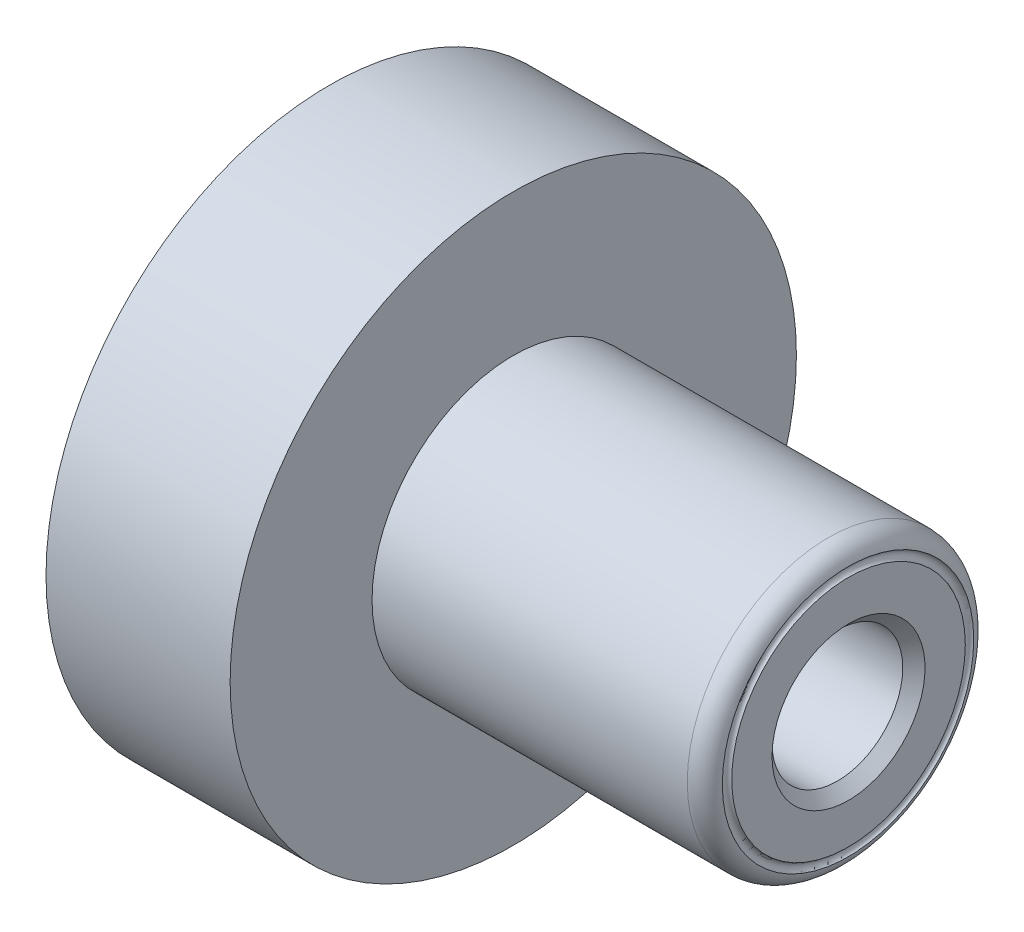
ISO-10303-21;
HEADER;
FILE_DESCRIPTION(('STEP AP214'),'2;1');
FILE_NAME('part.step','',(''),(''),'','','');
FILE_SCHEMA(('AUTOMOTIVE_DESIGN { 1 0 10303 214 1 1 1 1 }'));
ENDSEC;
DATA;
#1=APPLICATION_CONTEXT('core data for automotive mechanical design processes');
#2=APPLICATION_PROTOCOL_DEFINITION('international standard','automotive_design',2000,#1);
#3=PRODUCT_CONTEXT('',#1,'mechanical');
#4=PRODUCT('Part','Part','',(#3));
#5=PRODUCT_RELATED_PRODUCT_CATEGORY('part','',(#4));
#6=PRODUCT_DEFINITION_FORMATION('','',#4);
#7=PRODUCT_DEFINITION_CONTEXT('part definition',#1,'design');
#8=PRODUCT_DEFINITION('design','',#6,#7);
#9=PRODUCT_DEFINITION_SHAPE('','',#8);
#10=(LENGTH_UNIT() NAMED_UNIT(*) SI_UNIT(.MILLI.,.METRE.));
#11=(NAMED_UNIT(*) PLANE_ANGLE_UNIT() SI_UNIT($,.RADIAN.));
#12=(NAMED_UNIT(*) SI_UNIT($,.STERADIAN.) SOLID_ANGLE_UNIT());
#13=UNCERTAINTY_MEASURE_WITH_UNIT(LENGTH_MEASURE(1.E-05),#10,'distance_accuracy_value','');
#14=(GEOMETRIC_REPRESENTATION_CONTEXT(3) GLOBAL_UNCERTAINTY_ASSIGNED_CONTEXT((#13)) GLOBAL_UNIT_ASSIGNED_CONTEXT((#10,
#11,#12)) REPRESENTATION_CONTEXT('',''));
#15=CARTESIAN_POINT('',(0.,0.,0.));
#16=DIRECTION('',(0.,0.,1.));
#17=DIRECTION('',(1.,0.,0.));
#18=AXIS2_PLACEMENT_3D('',#15,#16,#17);
#19=CARTESIAN_POINT('',(40.767,9.5171,0.));
#20=DIRECTION('',(-1.,0.,0.));
#21=DIRECTION('',(0.,0.,1.));
#22=AXIS2_PLACEMENT_3D('',#19,#20,#21);
#23=PLANE('',#22);
#24=CARTESIAN_POINT('',(40.767,0.,0.));
#25=DIRECTION('',(-1.,0.,0.));
#26=DIRECTION('',(0.,0.,1.));
#27=AXIS2_PLACEMENT_3D('',#24,#25,#26);
#28=CIRCLE('',#27,6.00500000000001);
#29=CARTESIAN_POINT('',(40.767,0.,6.00500000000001));
#30=VERTEX_POINT('',#29);
#31=EDGE_CURVE('E10',#30,#30,#28,.T.);
#32=ORIENTED_EDGE('',*,*,#31,.T.);
#33=EDGE_LOOP('',(#32));
#34=FACE_BOUND('',#33,.T.);
#35=CARTESIAN_POINT('',(40.767,0.,0.));
#36=DIRECTION('',(1.,0.,0.));
#37=DIRECTION('',(0.,0.,-1.));
#38=AXIS2_PLACEMENT_3D('',#35,#36,#37);
#39=CIRCLE('',#38,9.16686455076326);
#40=CARTESIAN_POINT('',(40.767,0.,-9.16686455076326));
#41=VERTEX_POINT('',#40);
#42=EDGE_CURVE('E78',#41,#41,#39,.F.);
#43=ORIENTED_EDGE('',*,*,#42,.F.);
#44=EDGE_LOOP('',(#43));
#45=FACE_BOUND('',#44,.T.);
#46=ADVANCED_FACE('F31',(#34,#45),#23,.F.);
#47=CARTESIAN_POINT('',(39.197,0.,0.));
#48=DIRECTION('',(-1.,0.,0.));
#49=DIRECTION('',(0.,0.,1.));
#50=AXIS2_PLACEMENT_3D('',#47,#48,#49);
#51=TOROIDAL_SURFACE('',#50,9.5171,1.57);
#52=CARTESIAN_POINT('',(39.197,0.,0.));
#53=DIRECTION('',(-1.,0.,0.));
#54=DIRECTION('',(0.,0.,1.));
#55=AXIS2_PLACEMENT_3D('',#52,#53,#54);
#56=CIRCLE('',#55,11.0871);
#57=CARTESIAN_POINT('',(39.197,0.,11.0871));
#58=VERTEX_POINT('',#57);
#59=EDGE_CURVE('E48',#58,#58,#56,.T.);
#60=ORIENTED_EDGE('',*,*,#59,.F.);
#61=EDGE_LOOP('',(#60));
#62=FACE_BOUND('',#61,.T.);
#63=CARTESIAN_POINT('',(40.7276717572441,0.,0.));
#64=DIRECTION('',(1.,0.,0.));
#65=DIRECTION('',(0.,0.,-1.));
#66=AXIS2_PLACEMENT_3D('',#63,#64,#65);
#67=CIRCLE('',#66,9.86630477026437);
#68=CARTESIAN_POINT('',(40.7276717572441,0.,-9.86630477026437));
#69=VERTEX_POINT('',#68);
#70=EDGE_CURVE('E35',#69,#69,#67,.T.);
#71=ORIENTED_EDGE('',*,*,#70,.F.);
#72=EDGE_LOOP('',(#71));
#73=FACE_BOUND('',#72,.T.);
#74=ADVANCED_FACE('F87',(#62,#73),#51,.T.);
#75=CARTESIAN_POINT('',(0.,0.,0.));
#76=DIRECTION('',(-1.,0.,0.));
#77=DIRECTION('',(0.,0.,1.));
#78=AXIS2_PLACEMENT_3D('',#75,#76,#77);
#79=CYLINDRICAL_SURFACE('',#78,8.128);
#80=CARTESIAN_POINT('',(28.067,0.,0.));
#81=DIRECTION('',(-1.,0.,0.));
#82=DIRECTION('',(0.,0.,1.));
#83=AXIS2_PLACEMENT_3D('',#80,#81,#82);
#84=CIRCLE('',#83,8.128);
#85=CARTESIAN_POINT('',(28.067,0.,8.128));
#86=VERTEX_POINT('',#85);
#87=EDGE_CURVE('E43',#86,#86,#84,.T.);
#88=ORIENTED_EDGE('',*,*,#87,.F.);
#89=EDGE_LOOP('',(#88));
#90=FACE_BOUND('',#89,.T.);
#91=CARTESIAN_POINT('',(0.,0.,0.));
#92=DIRECTION('',(-1.,0.,0.));
#93=DIRECTION('',(0.,0.,1.));
#94=AXIS2_PLACEMENT_3D('',#91,#92,#93);
#95=CIRCLE('',#94,8.128);
#96=CARTESIAN_POINT('',(0.,0.,8.128));
#97=VERTEX_POINT('',#96);
#98=EDGE_CURVE('E60',#97,#97,#95,.T.);
#99=ORIENTED_EDGE('',*,*,#98,.T.);
#100=EDGE_LOOP('',(#99));
#101=FACE_BOUND('',#100,.T.);
#102=ADVANCED_FACE('F89',(#90,#101),#79,.F.);
#103=CARTESIAN_POINT('',(28.067,8.128,0.));
#104=DIRECTION('',(1.,0.,0.));
#105=DIRECTION('',(0.,0.,-1.));
#106=AXIS2_PLACEMENT_3D('',#103,#104,#105);
#107=PLANE('',#106);
#108=CARTESIAN_POINT('',(28.067,0.,0.));
#109=DIRECTION('',(1.,0.,0.));
#110=DIRECTION('',(0.,0.,-1.));
#111=AXIS2_PLACEMENT_3D('',#108,#109,#110);
#112=CIRCLE('',#111,5.13);
#113=CARTESIAN_POINT('',(28.067,0.,-5.13));
#114=VERTEX_POINT('',#113);
#115=EDGE_CURVE('E73',#114,#114,#112,.T.);
#116=ORIENTED_EDGE('',*,*,#115,.T.);
#117=EDGE_LOOP('',(#116));
#118=FACE_BOUND('',#117,.T.);
#119=ORIENTED_EDGE('',*,*,#87,.T.);
#120=EDGE_LOOP('',(#119));
#121=FACE_BOUND('',#120,.T.);
#122=ADVANCED_FACE('F96',(#118,#121),#107,.F.);
#123=CARTESIAN_POINT('',(0.,0.,0.));
#124=DIRECTION('',(-1.,0.,0.));
#125=DIRECTION('',(0.,0.,1.));
#126=AXIS2_PLACEMENT_3D('',#123,#124,#125);
#127=CYLINDRICAL_SURFACE('',#126,11.0871);
#128=CARTESIAN_POINT('',(14.4526,0.,0.));
#129=DIRECTION('',(-1.,0.,0.));
#130=DIRECTION('',(0.,0.,1.));
#131=AXIS2_PLACEMENT_3D('',#128,#129,#130);
#132=CIRCLE('',#131,11.0871);
#133=CARTESIAN_POINT('',(14.4526,0.,11.0871));
#134=VERTEX_POINT('',#133);
#135=EDGE_CURVE('E51',#134,#134,#132,.T.);
#136=ORIENTED_EDGE('',*,*,#135,.F.);
#137=EDGE_LOOP('',(#136));
#138=FACE_BOUND('',#137,.T.);
#139=ORIENTED_EDGE('',*,*,#59,.T.);
#140=EDGE_LOOP('',(#139));
#141=FACE_BOUND('',#140,.T.);
#142=ADVANCED_FACE('F101',(#138,#141),#127,.T.);
#143=CARTESIAN_POINT('',(14.4526,22.225,0.));
#144=DIRECTION('',(-1.,0.,0.));
#145=DIRECTION('',(0.,0.,1.));
#146=AXIS2_PLACEMENT_3D('',#143,#144,#145);
#147=PLANE('',#146);
#148=CARTESIAN_POINT('',(14.4526,0.,0.));
#149=DIRECTION('',(-1.,0.,0.));
#150=DIRECTION('',(0.,0.,1.));
#151=AXIS2_PLACEMENT_3D('',#148,#149,#150);
#152=CIRCLE('',#151,22.225);
#153=CARTESIAN_POINT('',(14.4526,0.,22.225));
#154=VERTEX_POINT('',#153);
#155=EDGE_CURVE('E54',#154,#154,#152,.T.);
#156=ORIENTED_EDGE('',*,*,#155,.F.);
#157=EDGE_LOOP('',(#156));
#158=FACE_BOUND('',#157,.T.);
#159=ORIENTED_EDGE('',*,*,#135,.T.);
#160=EDGE_LOOP('',(#159));
#161=FACE_BOUND('',#160,.T.);
#162=ADVANCED_FACE('F109',(#158,#161),#147,.F.);
#163=CARTESIAN_POINT('',(0.,0.,0.));
#164=DIRECTION('',(-1.,0.,0.));
#165=DIRECTION('',(0.,0.,1.));
#166=AXIS2_PLACEMENT_3D('',#163,#164,#165);
#167=CYLINDRICAL_SURFACE('',#166,22.225);
#168=CARTESIAN_POINT('',(0.,0.,0.));
#169=DIRECTION('',(-1.,0.,0.));
#170=DIRECTION('',(0.,0.,1.));
#171=AXIS2_PLACEMENT_3D('',#168,#169,#170);
#172=CIRCLE('',#171,22.225);
#173=CARTESIAN_POINT('',(0.,0.,22.225));
#174=VERTEX_POINT('',#173);
#175=EDGE_CURVE('E57',#174,#174,#172,.T.);
#176=ORIENTED_EDGE('',*,*,#175,.F.);
#177=EDGE_LOOP('',(#176));
#178=FACE_BOUND('',#177,.T.);
#179=ORIENTED_EDGE('',*,*,#155,.T.);
#180=EDGE_LOOP('',(#179));
#181=FACE_BOUND('',#180,.T.);
#182=ADVANCED_FACE('F121',(#178,#181),#167,.T.);
#183=CARTESIAN_POINT('',(0.,8.128,0.));
#184=DIRECTION('',(1.,0.,0.));
#185=DIRECTION('',(0.,0.,-1.));
#186=AXIS2_PLACEMENT_3D('',#183,#184,#185);
#187=PLANE('',#186);
#188=CARTESIAN_POINT('',(0.,0.,12.7));
#189=DIRECTION('',(-1.,0.,0.));
#190=DIRECTION('',(0.,0.,-1.));
#191=AXIS2_PLACEMENT_3D('',#188,#189,#190);
#192=CIRCLE('',#191,3.2004);
#193=CARTESIAN_POINT('',(0.,0.,9.4996));
#194=VERTEX_POINT('',#193);
#195=EDGE_CURVE('E70',#194,#194,#192,.T.);
#196=ORIENTED_EDGE('',*,*,#195,.F.);
#197=EDGE_LOOP('',(#196));
#198=FACE_BOUND('',#197,.T.);
#199=CARTESIAN_POINT('',(0.,0.,-12.7));
#200=DIRECTION('',(-1.,0.,0.));
#201=DIRECTION('',(0.,0.,1.));
#202=AXIS2_PLACEMENT_3D('',#199,#200,#201);
#203=CIRCLE('',#202,3.2004);
#204=CARTESIAN_POINT('',(0.,0.,-9.4996));
#205=VERTEX_POINT('',#204);
#206=EDGE_CURVE('E64',#205,#205,#203,.T.);
#207=ORIENTED_EDGE('',*,*,#206,.F.);
#208=EDGE_LOOP('',(#207));
#209=FACE_BOUND('',#208,.T.);
#210=ORIENTED_EDGE('',*,*,#98,.F.);
#211=EDGE_LOOP('',(#210));
#212=FACE_BOUND('',#211,.T.);
#213=ORIENTED_EDGE('',*,*,#175,.T.);
#214=EDGE_LOOP('',(#213));
#215=FACE_BOUND('',#214,.T.);
#216=ADVANCED_FACE('F117',(#198,#209,#212,#215),#187,.F.);
#217=CARTESIAN_POINT('',(7.9502,0.,-12.7));
#218=DIRECTION('',(-1.,0.,0.));
#219=DIRECTION('',(0.,0.,1.));
#220=AXIS2_PLACEMENT_3D('',#217,#218,#219);
#221=CYLINDRICAL_SURFACE('',#220,3.2004);
#222=CARTESIAN_POINT('',(7.9502,0.,-12.7));
#223=DIRECTION('',(-1.,0.,0.));
#224=DIRECTION('',(0.,0.,1.));
#225=AXIS2_PLACEMENT_3D('',#222,#223,#224);
#226=CIRCLE('',#225,3.2004);
#227=CARTESIAN_POINT('',(7.9502,0.,-9.4996));
#228=VERTEX_POINT('',#227);
#229=EDGE_CURVE('E63',#228,#228,#226,.T.);
#230=ORIENTED_EDGE('',*,*,#229,.F.);
#231=EDGE_LOOP('',(#230));
#232=FACE_BOUND('',#231,.T.);
#233=ORIENTED_EDGE('',*,*,#206,.T.);
#234=EDGE_LOOP('',(#233));
#235=FACE_BOUND('',#234,.T.);
#236=ADVANCED_FACE('F120',(#232,#235),#221,.F.);
#237=CARTESIAN_POINT('',(7.9502,0.,-12.7));
#238=DIRECTION('',(-1.,0.,0.));
#239=DIRECTION('',(0.,0.,1.));
#240=AXIS2_PLACEMENT_3D('',#237,#238,#239);
#241=PLANE('',#240);
#242=ORIENTED_EDGE('',*,*,#229,.T.);
#243=EDGE_LOOP('',(#242));
#244=FACE_BOUND('',#243,.T.);
#245=ADVANCED_FACE('F140',(#244),#241,.T.);
#246=CARTESIAN_POINT('',(7.9502,0.,12.7));
#247=DIRECTION('',(-1.,0.,0.));
#248=DIRECTION('',(0.,0.,1.));
#249=AXIS2_PLACEMENT_3D('',#246,#247,#248);
#250=CYLINDRICAL_SURFACE('',#249,3.2004);
#251=CARTESIAN_POINT('',(7.9502,0.,12.7));
#252=DIRECTION('',(-1.,0.,0.));
#253=DIRECTION('',(0.,0.,-1.));
#254=AXIS2_PLACEMENT_3D('',#251,#252,#253);
#255=CIRCLE('',#254,3.2004);
#256=CARTESIAN_POINT('',(7.9502,0.,9.4996));
#257=VERTEX_POINT('',#256);
#258=EDGE_CURVE('E67',#257,#257,#255,.T.);
#259=ORIENTED_EDGE('',*,*,#258,.F.);
#260=EDGE_LOOP('',(#259));
#261=FACE_BOUND('',#260,.T.);
#262=ORIENTED_EDGE('',*,*,#195,.T.);
#263=EDGE_LOOP('',(#262));
#264=FACE_BOUND('',#263,.T.);
#265=ADVANCED_FACE('F144',(#261,#264),#250,.F.);
#266=CARTESIAN_POINT('',(7.9502,0.,12.7));
#267=DIRECTION('',(1.,0.,0.));
#268=DIRECTION('',(0.,0.,-1.));
#269=AXIS2_PLACEMENT_3D('',#266,#267,#268);
#270=PLANE('',#269);
#271=ORIENTED_EDGE('',*,*,#258,.T.);
#272=EDGE_LOOP('',(#271));
#273=FACE_BOUND('',#272,.T.);
#274=ADVANCED_FACE('F148',(#273),#270,.F.);
#275=CARTESIAN_POINT('',(0.,0.,0.));
#276=DIRECTION('',(1.,0.,0.));
#277=DIRECTION('',(0.,0.,-1.));
#278=AXIS2_PLACEMENT_3D('',#275,#276,#277);
#279=CYLINDRICAL_SURFACE('',#278,5.13);
#280=CARTESIAN_POINT('',(39.892,0.,0.));
#281=DIRECTION('',(-1.,0.,0.));
#282=DIRECTION('',(0.,0.,1.));
#283=AXIS2_PLACEMENT_3D('',#280,#281,#282);
#284=CIRCLE('',#283,5.13);
#285=CARTESIAN_POINT('',(39.892,0.,5.13));
#286=VERTEX_POINT('',#285);
#287=EDGE_CURVE('E39',#286,#286,#284,.F.);
#288=ORIENTED_EDGE('',*,*,#287,.T.);
#289=EDGE_LOOP('',(#288));
#290=FACE_BOUND('',#289,.T.);
#291=ORIENTED_EDGE('',*,*,#115,.F.);
#292=EDGE_LOOP('',(#291));
#293=FACE_BOUND('',#292,.T.);
#294=ADVANCED_FACE('F152',(#290,#293),#279,.F.);
#295=CARTESIAN_POINT('',(39.892,0.,0.));
#296=DIRECTION('',(1.,0.,0.));
#297=DIRECTION('',(0.,0.,-1.));
#298=AXIS2_PLACEMENT_3D('',#295,#296,#297);
#299=CONICAL_SURFACE('',#298,5.13,0.785398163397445);
#300=ORIENTED_EDGE('',*,*,#31,.F.);
#301=EDGE_LOOP('',(#300));
#302=FACE_BOUND('',#301,.T.);
#303=ORIENTED_EDGE('',*,*,#287,.F.);
#304=EDGE_LOOP('',(#303));
#305=FACE_BOUND('',#304,.T.);
#306=ADVANCED_FACE('F33',(#302,#305),#299,.F.);
#307=CARTESIAN_POINT('',(40.897,0.,0.));
#308=DIRECTION('',(-1.,0.,0.));
#309=DIRECTION('',(0.,0.,1.));
#310=AXIS2_PLACEMENT_3D('',#307,#308,#309);
#311=TOROIDAL_SURFACE('',#310,9.525,0.381000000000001);
#312=ORIENTED_EDGE('',*,*,#70,.T.);
#313=EDGE_LOOP('',(#312));
#314=FACE_BOUND('',#313,.T.);
#315=ORIENTED_EDGE('',*,*,#42,.T.);
#316=EDGE_LOOP('',(#315));
#317=FACE_BOUND('',#316,.T.);
#318=ADVANCED_FACE('F85',(#314,#317),#311,.F.);
#319=CLOSED_SHELL('',(#46,#74,#102,#122,#142,#162,#182,#216,#236,#245,#265,#274,#294,#306,#318));
#320=MANIFOLD_SOLID_BREP('B2',#319);
#321=ADVANCED_BREP_SHAPE_REPRESENTATION('',(#18,#320),#14);
#322=SHAPE_DEFINITION_REPRESENTATION(#9,#321);
ENDSEC;
END-ISO-10303-21;
